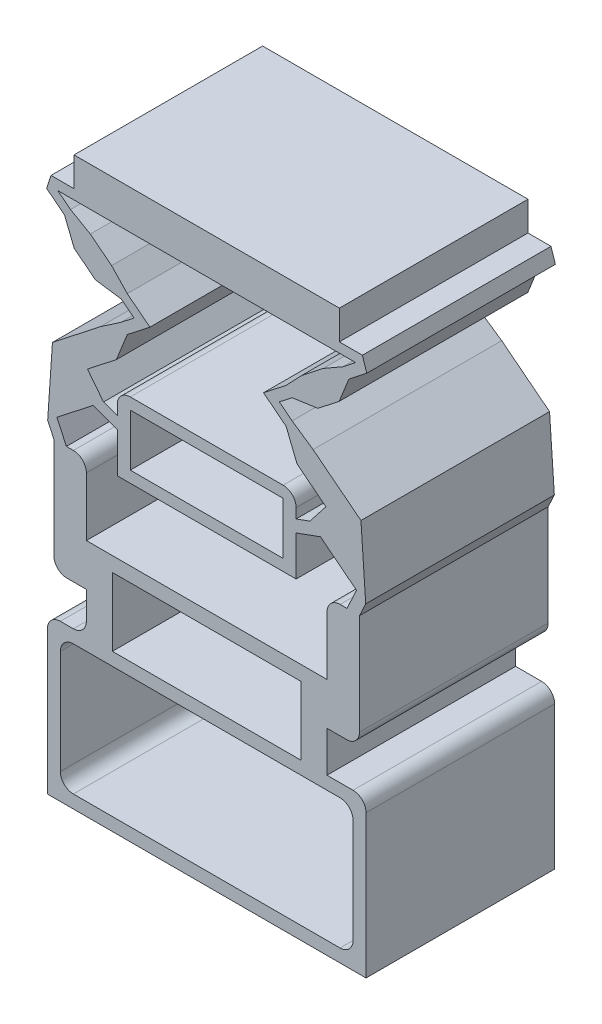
from build123d import *

# Parameters (mm, degrees)
EXTRUDE_1_DEPTH     = 5.8
SKETCH_10_W         = 5.8
SKETCH_10_H         = 2.1
SKETCH_10_W_2       = 4.7
SKETCH_10_H_2       = 1.6
CUT_EXTRUDE_3_DEPTH = 11.464273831
EXTRUDE_2_DEPTH     = 5.8
FILLET_1_R          = 0.4
CUT_EXTRUDE_4_DEPTH = 11.464273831
SKETCH_14_W         = 5.8
SKETCH_14_H         = 0.1
SKETCH_14_W_2       = 7.4
EXTRUDE_4_DEPTH     = 5.8
SKETCH_15_W         = 5.8
SKETCH_15_H         = 0.1
CUT_EXTRUDE_5_DEPTH = 10.961464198
EXTRUDE_3_DEPTH     = 5.8
SKETCH_16_W         = 9.8
SKETCH_16_H         = 4.8
SKETCH_16_W_2       = 9
SKETCH_16_H_2       = 4
EXTRUDE_5_DEPTH     = 5.8
FILLET_2_R          = 0.4
FILLET_3_R          = 0.4
SKETCH_17_W         = 9.301217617
SKETCH_17_H         = 4.332073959
EXTRUDE_6_DEPTH     = 0.3


with BuildPart() as part:
    # Sketch 1 → Extrude 1 (new body)
    with BuildSketch(Plane.XY):
        Polygon((2.75, 5.2), (3.172861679, 5.353909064), (4.036522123, 6.455766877), (5.8467171, 5.036896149), (4.983056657, 3.935038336), (4.890178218, 4.007838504), (4.7, 3.6), (4.7, 0.1), (3.7, 0.1), (3.7, -1.4), (-3.7, -1.4), (-3.7, 1.4), (3.7, 1.4), (3.7, 3.6), (4.313817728, 3.6), (4.607364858, 4.22951385), (3.497364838, 5.099556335), (2.75, 4.82753778), (2.75, 3.6), (-2.75, 3.6), (-2.75, 5.2), align=None)
    extrude_1 = extrude(amount=EXTRUDE_1_DEPTH)

    # Mirror 1: Extrude 1 across plane
    add(extrude_1.mirror(Plane(origin=(0, 0, 0), x_dir=(0, 0, 1), z_dir=(1, 0, 0))))

    # Sketch 10 → Cut-Extrude 3 (cut, through all)
    with BuildSketch(Plane.XY.offset(5.8)):
        Rectangle(SKETCH_10_W, SKETCH_10_H)
        with Locations((0, 4.75)):
            Rectangle(SKETCH_10_W_2, SKETCH_10_H_2)
    extrude(amount=-CUT_EXTRUDE_3_DEPTH, mode=Mode.SUBTRACT)

    # Sketch 11 → Extrude 2 (add)
    with BuildSketch(Plane.XY.offset(5.8)):
        Polygon((-2.35, 5.2), (-2.75, 5.2), (-2.75, 5.9), (2.75, 5.9), (2.75, 5.2), (2.35, 5.2), (2.35, 5.55), (-2.35, 5.55), align=None)
    extrude(amount=-EXTRUDE_2_DEPTH)

    # Fillet 1
    fillet_1_edges = [part.edges().sort_by_distance(p)[0] for p in [
        (2.75, 5.9, 2.9),
        (-2.75, 5.9, 2.9),
    ]]
    fillet(fillet_1_edges, radius=FILLET_1_R)

    # Sketch 13 → Cut-Extrude 4 (cut, through all)
    with BuildSketch(Plane.XY.offset(5.8)):
        Polygon((-4.890178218, 4.007838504), (-4.761721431, 5.887339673), (-5.8467171, 5.036896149), (-4.983056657, 3.935038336), align=None)
        Polygon((4.890178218, 4.007838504), (4.983056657, 3.935038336), (5.8467171, 5.036896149), (4.761721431, 5.887339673), align=None)
    extrude(amount=-CUT_EXTRUDE_4_DEPTH, mode=Mode.SUBTRACT)

    # Sketch 14 → Extrude 4 (add)
    with BuildSketch(Plane.XY.offset(5.8)):
        with Locations((0, 1)):
            Rectangle(SKETCH_14_W, SKETCH_14_H)
        with Locations((0, -1.45)):
            Rectangle(SKETCH_14_W_2, SKETCH_14_H)
    extrude(amount=-EXTRUDE_4_DEPTH)

    # Sketch 15 → Cut-Extrude 5 (cut, through all)
    with BuildSketch(Plane.XY.offset(5.8)):
        with Locations((0, -1.1)):
            Rectangle(SKETCH_15_W, SKETCH_15_H)
    extrude(amount=-CUT_EXTRUDE_5_DEPTH, mode=Mode.SUBTRACT)

    # Sketch 12 → Extrude 3 (add)
    with BuildSketch(Plane.XY.offset(5.8)):
        Polygon((-2.626886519, 7.751257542), (-2.233365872, 8.0597077), (-2.626886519, 8.368157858), (-3.41892485, 8.480742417), (-4.073443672, 8.993768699), (-4.37196175, 9.735986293), (-4.922890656, 10.167816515), (-4.788067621, 10.58054884), (-4.080412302, 10.58054884), (-4.080412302, 11.48054884), (4.080412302, 11.48054884), (4.080412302, 10.58054884), (4.788067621, 10.58054884), (4.922890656, 10.167816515), (4.37196175, 9.735986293), (4.073443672, 8.993768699), (3.41892485, 8.480742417), (2.626886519, 8.368157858), (2.233365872, 8.0597077), (2.626886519, 7.751257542), (3.271169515, 7.309783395), (4.743370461, 6.15583984), (4.761721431, 5.887339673), (4.036522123, 6.455766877), (3.666381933, 5.9835421), (2.777649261, 6.68015036), (2.441816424, 7.515145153), (1.747063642, 8.0597077), (2.441816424, 8.604270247), (2.925404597, 9.110375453), (3.579923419, 9.623401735), (4.186891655, 9.972098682), (4.580412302, 10.28054884), (4.080412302, 10.28054884), (-4.080412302, 10.28054884), (-4.580412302, 10.28054884), (-4.186891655, 9.972098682), (-3.579923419, 9.623401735), (-2.925404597, 9.110375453), (-2.441816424, 8.604270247), (-1.747063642, 8.0597077), (-2.441816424, 7.515145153), (-2.777649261, 6.68015036), (-3.666381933, 5.9835421), (-4.036522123, 6.455766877), (-4.761721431, 5.887339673), (-4.743370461, 6.15583984), (-3.271169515, 7.309783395), align=None)
    extrude(amount=-EXTRUDE_3_DEPTH)

    # Sketch 16 → Extrude 5 (add)
    with BuildSketch(Plane.XY.offset(5.8)):
        with Locations((0, -3.55)):
            Rectangle(SKETCH_16_W, SKETCH_16_H)
        with Locations((0, -3.55)):
            Rectangle(SKETCH_16_W_2, SKETCH_16_H_2, mode=Mode.SUBTRACT)
    extrude(amount=-EXTRUDE_5_DEPTH)

    # Fillet 2
    fillet_2_edges = [part.edges().sort_by_distance(p)[0] for p in [
        (4.7, 0.1, 2.9),
        (-4.9, -1.15, 2.9),
        (-3.7, -1.15, 2.9),
        (4.9, -1.15, 2.9),
        (-4.5, -1.55, 2.9),
        (4.5, -1.55, 2.9),
        (4.5, -5.55, 2.9),
        (-4.5, -5.55, 2.9),
        (-4.7, 0.1, 2.9),
    ]]
    fillet(fillet_2_edges, radius=FILLET_2_R)

    # Fillet 3
    fillet_3_edges = [part.edges().sort_by_distance(p)[0] for p in [
        (3.7, 3.6, 2.9),
        (-3.7, 3.6, 2.9),
    ]]
    fillet(fillet_3_edges, radius=FILLET_3_R)

    # Sketch 17 → Extrude 6 (add)
    with BuildSketch(Plane(origin=(0, 0, 0), x_dir=(-1, 0, 0), z_dir=(0, 0, -1))):
        with Locations((0.005385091, -3.541727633)):
            Rectangle(SKETCH_17_W, SKETCH_17_H)
    extrude(amount=-EXTRUDE_6_DEPTH)


solid = part.part
